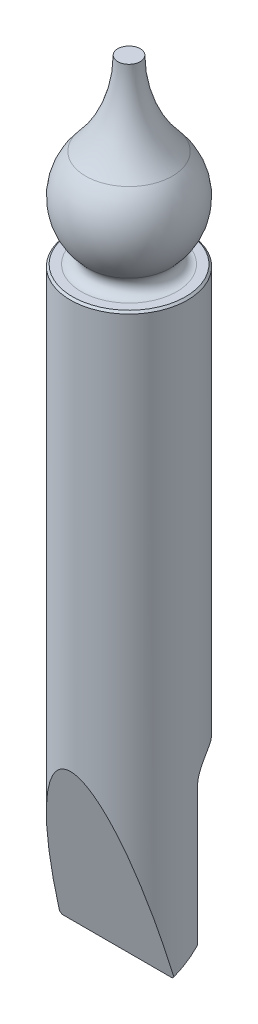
ISO-10303-21;
HEADER;
FILE_DESCRIPTION(('STEP AP214'),'2;1');
FILE_NAME('part.step','',(''),(''),'','','');
FILE_SCHEMA(('AUTOMOTIVE_DESIGN { 1 0 10303 214 1 1 1 1 }'));
ENDSEC;
DATA;
#1=APPLICATION_CONTEXT('core data for automotive mechanical design processes');
#2=APPLICATION_PROTOCOL_DEFINITION('international standard','automotive_design',2000,#1);
#3=PRODUCT_CONTEXT('',#1,'mechanical');
#4=PRODUCT('Part','Part','',(#3));
#5=PRODUCT_RELATED_PRODUCT_CATEGORY('part','',(#4));
#6=PRODUCT_DEFINITION_FORMATION('','',#4);
#7=PRODUCT_DEFINITION_CONTEXT('part definition',#1,'design');
#8=PRODUCT_DEFINITION('design','',#6,#7);
#9=PRODUCT_DEFINITION_SHAPE('','',#8);
#10=(LENGTH_UNIT() NAMED_UNIT(*) SI_UNIT(.MILLI.,.METRE.));
#11=(NAMED_UNIT(*) PLANE_ANGLE_UNIT() SI_UNIT($,.RADIAN.));
#12=(NAMED_UNIT(*) SI_UNIT($,.STERADIAN.) SOLID_ANGLE_UNIT());
#13=UNCERTAINTY_MEASURE_WITH_UNIT(LENGTH_MEASURE(1.E-05),#10,'distance_accuracy_value','');
#14=(GEOMETRIC_REPRESENTATION_CONTEXT(3) GLOBAL_UNCERTAINTY_ASSIGNED_CONTEXT((#13)) GLOBAL_UNIT_ASSIGNED_CONTEXT((#10,
#11,#12)) REPRESENTATION_CONTEXT('',''));
#15=CARTESIAN_POINT('',(0.,0.,0.));
#16=DIRECTION('',(0.,0.,1.));
#17=DIRECTION('',(1.,0.,0.));
#18=AXIS2_PLACEMENT_3D('',#15,#16,#17);
#19=CARTESIAN_POINT('',(-0.575,39.2822667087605,0.));
#20=DIRECTION('',(0.,-1.,0.));
#21=DIRECTION('',(0.,0.,-1.));
#22=AXIS2_PLACEMENT_3D('',#19,#20,#21);
#23=PLANE('',#22);
#24=CARTESIAN_POINT('',(0.,39.2822667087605,0.));
#25=DIRECTION('',(0.,-1.,0.));
#26=DIRECTION('',(0.,0.,-1.));
#27=AXIS2_PLACEMENT_3D('',#24,#25,#26);
#28=CIRCLE('',#27,0.575);
#29=CARTESIAN_POINT('',(0.,39.2822667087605,-0.575));
#30=VERTEX_POINT('',#29);
#31=EDGE_CURVE('E148',#30,#30,#28,.T.);
#32=ORIENTED_EDGE('',*,*,#31,.F.);
#33=EDGE_LOOP('',(#32));
#34=FACE_BOUND('',#33,.T.);
#35=ADVANCED_FACE('F35',(#34),#23,.F.);
#36=CARTESIAN_POINT('',(0.,39.2822667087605,0.));
#37=DIRECTION('',(0.,-1.,0.));
#38=DIRECTION('',(0.,0.,-1.));
#39=AXIS2_PLACEMENT_3D('',#36,#37,#38);
#40=TOROIDAL_SURFACE('',#39,6.925,6.35);
#41=CARTESIAN_POINT('',(0.,35.0157005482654,0.));
#42=DIRECTION('',(0.,-1.,0.));
#43=DIRECTION('',(0.,0.,-1.));
#44=AXIS2_PLACEMENT_3D('',#41,#42,#43);
#45=CIRCLE('',#44,2.22192513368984);
#46=CARTESIAN_POINT('',(-2.22192513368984,35.0157005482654,0.));
#47=VERTEX_POINT('',#46);
#48=EDGE_CURVE('E158',#47,#47,#45,.T.);
#49=ORIENTED_EDGE('',*,*,#48,.F.);
#50=EDGE_LOOP('',(#49));
#51=FACE_BOUND('',#50,.T.);
#52=ORIENTED_EDGE('',*,*,#31,.T.);
#53=EDGE_LOOP('',(#52));
#54=FACE_BOUND('',#53,.T.);
#55=ADVANCED_FACE('F442',(#51,#54),#40,.F.);
#56=CARTESIAN_POINT('',(0.,33.,0.));
#57=DIRECTION('',(0.,-1.,0.));
#58=DIRECTION('',(-1.,0.,0.));
#59=AXIS2_PLACEMENT_3D('',#56,#57,#58);
#60=SPHERICAL_SURFACE('',#59,3.);
#61=CARTESIAN_POINT('',(0.,30.8571428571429,0.));
#62=DIRECTION('',(0.,-1.,0.));
#63=DIRECTION('',(0.,0.,-1.));
#64=AXIS2_PLACEMENT_3D('',#61,#62,#63);
#65=CIRCLE('',#64,2.09956263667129);
#66=CARTESIAN_POINT('',(-2.0995626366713,30.8571428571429,0.));
#67=VERTEX_POINT('',#66);
#68=EDGE_CURVE('E140',#67,#67,#65,.T.);
#69=CARTESIAN_POINT('',(-2.0995626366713,30.8571428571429,0.));
#70=CARTESIAN_POINT('',(-2.1337681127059,30.8906559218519,0.));
#71=CARTESIAN_POINT('',(-2.16716980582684,30.9249892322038,0.));
#72=CARTESIAN_POINT('',(-2.23229208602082,30.9952148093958,0.));
#73=CARTESIAN_POINT('',(-2.26401267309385,31.0311070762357,0.));
#74=CARTESIAN_POINT('',(-2.32569920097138,31.1043690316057,0.));
#75=CARTESIAN_POINT('',(-2.35566514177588,31.1417387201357,0.));
#76=CARTESIAN_POINT('',(-2.41377389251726,31.2178696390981,0.));
#77=CARTESIAN_POINT('',(-2.44191670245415,31.2566308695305,0.));
#78=CARTESIAN_POINT('',(-2.49631461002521,31.3354560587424,0.));
#79=CARTESIAN_POINT('',(-2.52256970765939,31.3755200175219,0.));
#80=CARTESIAN_POINT('',(-2.57313201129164,31.4568587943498,0.));
#81=CARTESIAN_POINT('',(-2.5974392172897,31.4981336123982,0.));
#82=CARTESIAN_POINT('',(-2.64405000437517,31.581799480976,0.));
#83=CARTESIAN_POINT('',(-2.66635358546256,31.6241905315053,0.));
#84=CARTESIAN_POINT('',(-2.70890598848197,31.7099916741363,0.));
#85=CARTESIAN_POINT('',(-2.72915481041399,31.753401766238,0.));
#86=CARTESIAN_POINT('',(-2.76755127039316,31.8411414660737,0.));
#87=CARTESIAN_POINT('',(-2.78569890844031,31.8854710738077,0.));
#88=CARTESIAN_POINT('',(-2.81985139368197,31.9749481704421,0.));
#89=CARTESIAN_POINT('',(-2.83585624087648,32.0200956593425,0.));
#90=CARTESIAN_POINT('',(-2.86568645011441,32.1111050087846,0.));
#91=CARTESIAN_POINT('',(-2.87951181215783,32.1569668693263,0.));
#92=CARTESIAN_POINT('',(-2.90495135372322,32.2492998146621,0.));
#93=CARTESIAN_POINT('',(-2.9165655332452,32.2957708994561,0.));
#94=CARTESIAN_POINT('',(-2.93755608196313,32.3892157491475,0.));
#95=CARTESIAN_POINT('',(-2.94693245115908,32.4361895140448,0.));
#96=CARTESIAN_POINT('',(-2.96342588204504,32.5305320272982,0.));
#97=CARTESIAN_POINT('',(-2.97054294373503,32.5779007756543,0.));
#98=CARTESIAN_POINT('',(-2.98250144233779,32.6729246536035,0.));
#99=CARTESIAN_POINT('',(-2.98734287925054,32.7205797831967,0.));
#100=CARTESIAN_POINT('',(-2.99473902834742,32.8160671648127,0.));
#101=CARTESIAN_POINT('',(-2.99729374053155,32.8638994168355,0.));
#102=CARTESIAN_POINT('',(-3.00011058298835,32.9596313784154,0.));
#103=CARTESIAN_POINT('',(-3.00037271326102,33.0075310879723,0.));
#104=CARTESIAN_POINT('',(-2.99860379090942,33.1032881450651,0.));
#105=CARTESIAN_POINT('',(-2.99657273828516,33.1511454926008,0.));
#106=CARTESIAN_POINT('',(-2.99022210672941,33.2467081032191,0.));
#107=CARTESIAN_POINT('',(-2.98590252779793,33.2944133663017,0.));
#108=CARTESIAN_POINT('',(-2.97498474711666,33.3895624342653,0.));
#109=CARTESIAN_POINT('',(-2.96838654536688,33.4370062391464,0.));
#110=CARTESIAN_POINT('',(-2.95292664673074,33.5315236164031,0.));
#111=CARTESIAN_POINT('',(-2.94406494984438,33.5785971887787,0.));
#112=CARTESIAN_POINT('',(-2.92409837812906,33.6722661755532,0.));
#113=CARTESIAN_POINT('',(-2.91299350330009,33.7188615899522,0.));
#114=CARTESIAN_POINT('',(-2.88856603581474,33.8114674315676,0.));
#115=CARTESIAN_POINT('',(-2.87524344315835,33.8574778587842,0.));
#116=CARTESIAN_POINT('',(-2.84641108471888,33.9488082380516,0.));
#117=CARTESIAN_POINT('',(-2.83090131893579,33.9941281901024,0.));
#118=CARTESIAN_POINT('',(-2.79773017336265,34.0839737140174,0.));
#119=CARTESIAN_POINT('',(-2.7800687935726,34.1284992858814,0.));
#120=CARTESIAN_POINT('',(-2.74263491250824,34.2166539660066,0.));
#121=CARTESIAN_POINT('',(-2.72286241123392,34.2602830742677,0.));
#122=CARTESIAN_POINT('',(-2.68125161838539,34.3465447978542,0.));
#123=CARTESIAN_POINT('',(-2.65941332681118,34.3891774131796,0.));
#124=CARTESIAN_POINT('',(-2.61372102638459,34.4733484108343,0.));
#125=CARTESIAN_POINT('',(-2.58986701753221,34.5148867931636,0.));
#126=CARTESIAN_POINT('',(-2.54019795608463,34.5967740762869,0.));
#127=CARTESIAN_POINT('',(-2.51438290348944,34.6371229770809,0.));
#128=CARTESIAN_POINT('',(-2.46085100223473,34.7165388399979,0.));
#129=CARTESIAN_POINT('',(-2.43313415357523,34.7556058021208,0.));
#130=CARTESIAN_POINT('',(-2.37586197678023,34.8323680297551,0.));
#131=CARTESIAN_POINT('',(-2.34630664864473,34.8700632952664,0.));
#132=CARTESIAN_POINT('',(-2.28542613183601,34.9439964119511,0.));
#133=CARTESIAN_POINT('',(-2.25410094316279,34.9802342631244,0.));
#134=CARTESIAN_POINT('',(-2.22192513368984,35.0157005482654,0.));
#135=B_SPLINE_CURVE_WITH_KNOTS('',3,(#69,#70,#71,#72,#73,#74,#75,#76,#77,#78,#79,#80,#81,#82,
#83,#84,#85,#86,#87,#88,#89,#90,#91,#92,#93,#94,#95,#96,#97,#98,#99,#100,#101,#102,#103,#104,
#105,#106,#107,#108,#109,#110,#111,#112,#113,#114,#115,#116,#117,#118,#119,#120,#121,#122,#123,
#124,#125,#126,#127,#128,#129,#130,#131,#132,#133,#134),.UNSPECIFIED.,.F.,.F.,(4,2,2,2,2,2,2,2,
2,2,2,2,2,2,2,2,2,2,2,2,2,2,2,2,2,2,2,2,2,2,2,2,4),(0.,0.143646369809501,0.287292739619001,
0.430939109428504,0.574585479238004,0.718231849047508,0.86187821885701,1.00552458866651,
1.14917095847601,1.29281732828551,1.43646369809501,1.58011006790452,1.72375643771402,
1.86740280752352,2.01104917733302,2.15469554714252,2.29834191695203,2.44198828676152,
2.58563465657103,2.72928102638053,2.87292739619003,3.01657376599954,3.16022013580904,
3.30386650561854,3.44751287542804,3.59115924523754,3.73480561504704,3.87845198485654,
4.02209835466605,4.16574472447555,4.30939109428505,4.45303746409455,4.59668383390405),.UNSPECIFIED.);
#136=EDGE_CURVE('BSEAM446',#67,#47,#135,.T.);
#137=ORIENTED_EDGE('',*,*,#68,.F.);
#138=ORIENTED_EDGE('',*,*,#48,.T.);
#139=ORIENTED_EDGE('',*,*,#136,.T.);
#140=ORIENTED_EDGE('',*,*,#136,.F.);
#141=EDGE_LOOP('',(#137,#139,#138,#140));
#142=FACE_BOUND('',#141,.T.);
#143=ADVANCED_FACE('F446',(#142),#60,.T.);
#144=CARTESIAN_POINT('',(0.,30.5,0.));
#145=DIRECTION('',(0.,-1.,0.));
#146=DIRECTION('',(0.,0.,-1.));
#147=AXIS2_PLACEMENT_3D('',#144,#145,#146);
#148=TOROIDAL_SURFACE('',#147,2.44948974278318,0.500000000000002);
#149=CARTESIAN_POINT('',(0.,30.,0.));
#150=DIRECTION('',(0.,-1.,0.));
#151=DIRECTION('',(0.,0.,-1.));
#152=AXIS2_PLACEMENT_3D('',#149,#150,#151);
#153=CIRCLE('',#152,2.44948974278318);
#154=CARTESIAN_POINT('',(0.,30.,-2.44948974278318));
#155=VERTEX_POINT('',#154);
#156=EDGE_CURVE('E136',#155,#155,#153,.T.);
#157=ORIENTED_EDGE('',*,*,#156,.F.);
#158=EDGE_LOOP('',(#157));
#159=FACE_BOUND('',#158,.T.);
#160=ORIENTED_EDGE('',*,*,#68,.T.);
#161=EDGE_LOOP('',(#160));
#162=FACE_BOUND('',#161,.T.);
#163=ADVANCED_FACE('F449',(#159,#162),#148,.F.);
#164=CARTESIAN_POINT('',(-3.,30.,0.));
#165=DIRECTION('',(0.,-1.,0.));
#166=DIRECTION('',(0.,0.,-1.));
#167=AXIS2_PLACEMENT_3D('',#164,#165,#166);
#168=PLANE('',#167);
#169=CARTESIAN_POINT('',(0.,30.,0.));
#170=DIRECTION('',(0.,-1.,0.));
#171=DIRECTION('',(0.,0.,-1.));
#172=AXIS2_PLACEMENT_3D('',#169,#170,#171);
#173=CIRCLE('',#172,2.89999999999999);
#174=CARTESIAN_POINT('',(0.,30.,-2.89999999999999));
#175=VERTEX_POINT('',#174);
#176=EDGE_CURVE('E12',#175,#175,#173,.F.);
#177=ORIENTED_EDGE('',*,*,#176,.T.);
#178=EDGE_LOOP('',(#177));
#179=FACE_BOUND('',#178,.T.);
#180=ORIENTED_EDGE('',*,*,#156,.T.);
#181=EDGE_LOOP('',(#180));
#182=FACE_BOUND('',#181,.T.);
#183=ADVANCED_FACE('F202',(#179,#182),#168,.F.);
#184=CARTESIAN_POINT('',(0.,0.,0.));
#185=DIRECTION('',(0.,-1.,0.));
#186=DIRECTION('',(0.,0.,-1.));
#187=AXIS2_PLACEMENT_3D('',#184,#185,#186);
#188=CYLINDRICAL_SURFACE('',#187,3.);
#189=CARTESIAN_POINT('',(0.,29.9,0.));
#190=DIRECTION('',(0.,-1.,0.));
#191=DIRECTION('',(0.,0.,-1.));
#192=AXIS2_PLACEMENT_3D('',#189,#190,#191);
#193=CIRCLE('',#192,3.);
#194=CARTESIAN_POINT('',(0.,29.9,-3.));
#195=VERTEX_POINT('',#194);
#196=EDGE_CURVE('E150',#195,#195,#193,.T.);
#197=ORIENTED_EDGE('',*,*,#196,.T.);
#198=EDGE_LOOP('',(#197));
#199=FACE_BOUND('',#198,.T.);
#200=DIRECTION('',(0.,-1.,0.));
#201=VECTOR('',#200,1.);
#202=CARTESIAN_POINT('',(-2.9449100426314,0.,-0.572280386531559));
#203=LINE('',#202,#201);
#204=CARTESIAN_POINT('',(-2.9449100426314,8.,-0.572280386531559));
#205=VERTEX_POINT('',#204);
#206=CARTESIAN_POINT('',(-2.94495254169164,0.935010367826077,-0.572286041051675));
#207=VERTEX_POINT('',#206);
#208=EDGE_CURVE('E128',#205,#207,#203,.T.);
#209=ORIENTED_EDGE('',*,*,#208,.T.);
#210=CARTESIAN_POINT('',(-2.90538851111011,0.0386896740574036,0.747474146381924));
#211=CARTESIAN_POINT('',(-3.0298907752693,0.365899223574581,0.265682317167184));
#212=CARTESIAN_POINT('',(-3.03145923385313,0.714185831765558,-0.247143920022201));
#213=CARTESIAN_POINT('',(-2.90990635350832,1.04190647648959,-0.729688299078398));
#214=B_SPLINE_CURVE_WITH_KNOTS('',3,(#210,#211,#212,#213),.UNSPECIFIED.,.F.,.F.,(4,4),
(4.46669509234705,4.96419976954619),.UNSPECIFIED.);
#215=CARTESIAN_POINT('',(-2.93278718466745,0.117462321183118,0.631473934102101));
#216=VERTEX_POINT('',#215);
#217=EDGE_CURVE('E109',#207,#216,#214,.F.);
#218=ORIENTED_EDGE('',*,*,#217,.T.);
#219=CARTESIAN_POINT('',(0.,-2.23923048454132,0.));
#220=DIRECTION('',(0.,0.258819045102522,-0.965925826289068));
#221=DIRECTION('',(0.,-0.965925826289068,-0.258819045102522));
#222=AXIS2_PLACEMENT_3D('',#219,#220,#221);
#223=ELLIPSE('',#222,11.5911099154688,3.);
#224=CARTESIAN_POINT('',(2.93278718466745,0.117462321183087,0.631473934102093));
#225=VERTEX_POINT('',#224);
#226=EDGE_CURVE('E125',#216,#225,#223,.T.);
#227=ORIENTED_EDGE('',*,*,#226,.T.);
#228=CARTESIAN_POINT('',(2.90990635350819,1.04190647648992,-0.729688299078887));
#229=CARTESIAN_POINT('',(3.03145923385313,0.714185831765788,-0.24714392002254));
#230=CARTESIAN_POINT('',(3.02989077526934,0.365899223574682,0.265682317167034));
#231=CARTESIAN_POINT('',(2.9053885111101,0.0386896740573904,0.747474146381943));
#232=B_SPLINE_CURVE_WITH_KNOTS('',3,(#228,#229,#230,#231),.UNSPECIFIED.,.F.,.F.,(4,4),
(1.31898553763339,1.8164902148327),.UNSPECIFIED.);
#233=CARTESIAN_POINT('',(2.9449100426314,0.935010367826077,-0.572280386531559));
#234=VERTEX_POINT('',#233);
#235=EDGE_CURVE('E130',#225,#234,#232,.F.);
#236=ORIENTED_EDGE('',*,*,#235,.T.);
#237=DIRECTION('',(0.,-1.,0.));
#238=VECTOR('',#237,1.);
#239=CARTESIAN_POINT('',(2.9449100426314,0.,-0.572280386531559));
#240=LINE('',#239,#238);
#241=CARTESIAN_POINT('',(2.9449100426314,8.,-0.572280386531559));
#242=VERTEX_POINT('',#241);
#243=EDGE_CURVE('E166',#234,#242,#240,.F.);
#244=ORIENTED_EDGE('',*,*,#243,.T.);
#245=CARTESIAN_POINT('',(2.41702691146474,9.15253919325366,-1.77707087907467));
#246=CARTESIAN_POINT('',(2.8330422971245,9.19197157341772,-1.23380111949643));
#247=CARTESIAN_POINT('',(2.95387614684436,8.6679028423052,-0.546867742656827));
#248=CARTESIAN_POINT('',(2.9449100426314,8.,-0.57228038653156));
#249=B_SPLINE_CURVE_WITH_KNOTS('',3,(#245,#246,#247,#248),.UNSPECIFIED.,.F.,.F.,(4,4),(0.,
0.00190616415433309),.UNSPECIFIED.);
#250=CARTESIAN_POINT('',(2.41702691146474,9.15253919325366,-1.77707087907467));
#251=VERTEX_POINT('',#250);
#252=EDGE_CURVE('E169',#242,#251,#249,.F.);
#253=ORIENTED_EDGE('',*,*,#252,.T.);
#254=CARTESIAN_POINT('',(0.,9.15253919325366,0.));
#255=DIRECTION('',(0.,1.,0.));
#256=DIRECTION('',(0.,0.,1.));
#257=AXIS2_PLACEMENT_3D('',#254,#255,#256);
#258=CIRCLE('',#257,3.);
#259=CARTESIAN_POINT('',(-2.41702691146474,9.15253919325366,-1.77707087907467));
#260=VERTEX_POINT('',#259);
#261=EDGE_CURVE('E173',#251,#260,#258,.T.);
#262=ORIENTED_EDGE('',*,*,#261,.T.);
#263=CARTESIAN_POINT('',(-2.9449100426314,8.,-0.572280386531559));
#264=CARTESIAN_POINT('',(-2.95358423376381,8.67201574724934,-0.548573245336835));
#265=CARTESIAN_POINT('',(-2.83230342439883,9.19113963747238,-1.23508206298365));
#266=CARTESIAN_POINT('',(-2.41702691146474,9.15253919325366,-1.77707087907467));
#267=B_SPLINE_CURVE_WITH_KNOTS('',3,(#263,#264,#265,#266),.UNSPECIFIED.,.F.,.F.,(4,4),(0.,
0.00190531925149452),.UNSPECIFIED.);
#268=EDGE_CURVE('E182',#260,#205,#267,.F.);
#269=ORIENTED_EDGE('',*,*,#268,.T.);
#270=EDGE_LOOP('',(#209,#218,#227,#236,#244,#253,#262,#269));
#271=FACE_BOUND('',#270,.T.);
#272=ADVANCED_FACE('F124',(#199,#271),#188,.T.);
#273=CARTESIAN_POINT('',(-5.,0.913655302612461,-0.7));
#274=DIRECTION('',(0.,0.,1.));
#275=DIRECTION('',(1.,0.,0.));
#276=AXIS2_PLACEMENT_3D('',#273,#274,#275);
#277=PLANE('',#276);
#278=DIRECTION('',(1.,0.,0.));
#279=VECTOR('',#278,1.);
#280=CARTESIAN_POINT('',(-5.,0.913655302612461,-0.7));
#281=LINE('',#280,#279);
#282=CARTESIAN_POINT('',(-2.82410340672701,0.908048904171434,-0.698099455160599));
#283=VERTEX_POINT('',#282);
#284=CARTESIAN_POINT('',(2.82411201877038,0.908035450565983,-0.698094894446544));
#285=VERTEX_POINT('',#284);
#286=EDGE_CURVE('E137',#283,#285,#281,.T.);
#287=ORIENTED_EDGE('',*,*,#286,.F.);
#288=DIRECTION('',(0.,1.,0.));
#289=VECTOR('',#288,1.);
#290=CARTESIAN_POINT('',(-2.81719042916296,0.913655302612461,-0.7));
#291=LINE('',#290,#289);
#292=CARTESIAN_POINT('',(-2.81719042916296,8.,-0.700000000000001));
#293=VERTEX_POINT('',#292);
#294=EDGE_CURVE('E317',#283,#293,#291,.T.);
#295=ORIENTED_EDGE('',*,*,#294,.T.);
#296=DIRECTION('',(1.,0.,0.));
#297=VECTOR('',#296,1.);
#298=CARTESIAN_POINT('',(-5.,8.,-0.700000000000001));
#299=LINE('',#298,#297);
#300=CARTESIAN_POINT('',(2.81719042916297,8.,-0.700000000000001));
#301=VERTEX_POINT('',#300);
#302=EDGE_CURVE('E143',#293,#301,#299,.T.);
#303=ORIENTED_EDGE('',*,*,#302,.T.);
#304=DIRECTION('',(0.,-1.,0.));
#305=VECTOR('',#304,1.);
#306=CARTESIAN_POINT('',(2.81719042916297,0.913655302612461,-0.7));
#307=LINE('',#306,#305);
#308=EDGE_CURVE('E241',#301,#285,#307,.T.);
#309=ORIENTED_EDGE('',*,*,#308,.T.);
#310=EDGE_LOOP('',(#287,#295,#303,#309));
#311=FACE_BOUND('',#310,.T.);
#312=ADVANCED_FACE('F201',(#311),#277,.F.);
#313=CARTESIAN_POINT('',(-5.,8.,-1.7));
#314=DIRECTION('',(1.,0.,0.));
#315=DIRECTION('',(0.,0.,-1.));
#316=AXIS2_PLACEMENT_3D('',#313,#314,#315);
#317=CYLINDRICAL_SURFACE('',#316,1.);
#318=ORIENTED_EDGE('',*,*,#302,.F.);
#319=CARTESIAN_POINT('',(-2.31220138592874,9.,-1.7));
#320=CARTESIAN_POINT('',(-2.70946751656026,9.03349165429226,-1.25013853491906));
#321=CARTESIAN_POINT('',(-2.82548842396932,8.58307409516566,-0.680322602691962));
#322=CARTESIAN_POINT('',(-2.81719042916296,8.,-0.700000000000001));
#323=B_SPLINE_CURVE_WITH_KNOTS('',3,(#319,#320,#321,#322),.UNSPECIFIED.,.F.,.F.,(4,4),(0.,
0.00190531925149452),.UNSPECIFIED.);
#324=CARTESIAN_POINT('',(-2.31220138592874,9.,-1.7));
#325=VERTEX_POINT('',#324);
#326=EDGE_CURVE('E58',#293,#325,#323,.F.);
#327=ORIENTED_EDGE('',*,*,#326,.T.);
#328=DIRECTION('',(1.,0.,0.));
#329=VECTOR('',#328,1.);
#330=CARTESIAN_POINT('',(-5.,9.,-1.7));
#331=LINE('',#330,#329);
#332=CARTESIAN_POINT('',(2.31220138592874,9.,-1.7));
#333=VERTEX_POINT('',#332);
#334=EDGE_CURVE('E609',#325,#333,#331,.T.);
#335=ORIENTED_EDGE('',*,*,#334,.T.);
#336=CARTESIAN_POINT('',(2.81719042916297,8.,-0.700000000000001));
#337=CARTESIAN_POINT('',(2.82576767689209,8.5795055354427,-0.678907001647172));
#338=CARTESIAN_POINT('',(2.71017434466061,9.03421348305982,-1.24907532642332));
#339=CARTESIAN_POINT('',(2.31220138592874,9.,-1.7));
#340=B_SPLINE_CURVE_WITH_KNOTS('',3,(#336,#337,#338,#339),.UNSPECIFIED.,.F.,.F.,(4,4),(0.,
0.00190616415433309),.UNSPECIFIED.);
#341=EDGE_CURVE('E307',#333,#301,#340,.F.);
#342=ORIENTED_EDGE('',*,*,#341,.T.);
#343=EDGE_LOOP('',(#318,#327,#335,#342));
#344=FACE_BOUND('',#343,.T.);
#345=ADVANCED_FACE('F519',(#344),#317,.F.);
#346=CARTESIAN_POINT('',(-5.,9.,-1.7));
#347=DIRECTION('',(0.,1.,0.));
#348=DIRECTION('',(0.,0.,1.));
#349=AXIS2_PLACEMENT_3D('',#346,#347,#348);
#350=PLANE('',#349);
#351=ORIENTED_EDGE('',*,*,#334,.F.);
#352=CARTESIAN_POINT('',(0.,9.,0.));
#353=DIRECTION('',(0.,1.,0.));
#354=DIRECTION('',(0.,0.,1.));
#355=AXIS2_PLACEMENT_3D('',#352,#353,#354);
#356=CIRCLE('',#355,2.86989115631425);
#357=EDGE_CURVE('E45',#325,#333,#356,.F.);
#358=ORIENTED_EDGE('',*,*,#357,.T.);
#359=EDGE_LOOP('',(#351,#358));
#360=FACE_BOUND('',#359,.T.);
#361=ADVANCED_FACE('F512',(#360),#350,.F.);
#362=CARTESIAN_POINT('',(-5.,0.,0.599999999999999));
#363=DIRECTION('',(0.,0.818149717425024,0.575005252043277));
#364=DIRECTION('',(0.,-0.575005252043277,0.818149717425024));
#365=AXIS2_PLACEMENT_3D('',#362,#363,#364);
#366=PLANE('',#365);
#367=DIRECTION('',(1.,0.,0.));
#368=VECTOR('',#367,1.);
#369=CARTESIAN_POINT('',(-5.,0.,0.599999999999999));
#370=LINE('',#369,#368);
#371=CARTESIAN_POINT('',(-2.82324746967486,0.,0.599999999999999));
#372=VERTEX_POINT('',#371);
#373=CARTESIAN_POINT('',(2.82324485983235,0.,0.599999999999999));
#374=VERTEX_POINT('',#373);
#375=EDGE_CURVE('E233',#372,#374,#370,.T.);
#376=ORIENTED_EDGE('',*,*,#375,.F.);
#377=CARTESIAN_POINT('',(-2.81194308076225,0.958469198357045,-0.76376372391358));
#378=CARTESIAN_POINT('',(-2.929403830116,0.630748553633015,-0.297464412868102));
#379=CARTESIAN_POINT('',(-2.92788817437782,0.282461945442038,0.198097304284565));
#380=CARTESIAN_POINT('',(-2.80757733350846,-0.0447476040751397,0.663669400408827));
#381=B_SPLINE_CURVE_WITH_KNOTS('',3,(#377,#378,#379,#380),.UNSPECIFIED.,.F.,.F.,(4,4),
(4.46669509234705,4.96419976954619),.UNSPECIFIED.);
#382=EDGE_CURVE('E111',#372,#283,#381,.F.);
#383=ORIENTED_EDGE('',*,*,#382,.T.);
#384=ORIENTED_EDGE('',*,*,#286,.T.);
#385=CARTESIAN_POINT('',(2.80757733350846,-0.0447476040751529,0.663669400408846));
#386=CARTESIAN_POINT('',(2.92788817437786,0.282461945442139,0.198097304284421));
#387=CARTESIAN_POINT('',(2.929403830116,0.630748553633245,-0.297464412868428));
#388=CARTESIAN_POINT('',(2.81194308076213,0.958469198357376,-0.763763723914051));
#389=B_SPLINE_CURVE_WITH_KNOTS('',3,(#385,#386,#387,#388),.UNSPECIFIED.,.F.,.F.,(4,4),
(1.31898553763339,1.8164902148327),.UNSPECIFIED.);
#390=EDGE_CURVE('E118',#285,#374,#389,.F.);
#391=ORIENTED_EDGE('',*,*,#390,.T.);
#392=EDGE_LOOP('',(#376,#383,#384,#391));
#393=FACE_BOUND('',#392,.T.);
#394=ADVANCED_FACE('F203',(#393),#366,.F.);
#395=CARTESIAN_POINT('',(-5.,0.,0.599999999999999));
#396=DIRECTION('',(0.,0.258819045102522,-0.965925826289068));
#397=DIRECTION('',(0.,0.965925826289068,0.258819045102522));
#398=AXIS2_PLACEMENT_3D('',#395,#396,#397);
#399=PLANE('',#398);
#400=ORIENTED_EDGE('',*,*,#226,.F.);
#401=CARTESIAN_POINT('',(-2.82324719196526,-8.30603192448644E-07,0.6000011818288));
#402=CARTESIAN_POINT('',(-2.82781514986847,0.00488963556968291,0.601386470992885));
#403=CARTESIAN_POINT('',(-2.83238411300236,0.00978168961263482,0.602762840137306));
#404=CARTESIAN_POINT('',(-2.84152168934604,0.0195665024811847,0.605497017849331));
#405=CARTESIAN_POINT('',(-2.84609030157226,0.0244592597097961,0.60685483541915));
#406=CARTESIAN_POINT('',(-2.85522711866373,0.0342454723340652,0.609551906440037));
#407=CARTESIAN_POINT('',(-2.85979532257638,0.0391389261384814,0.610891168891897));
#408=CARTESIAN_POINT('',(-2.86893126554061,0.0489265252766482,0.613551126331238));
#409=CARTESIAN_POINT('',(-2.87349900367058,0.0538206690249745,0.614871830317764));
#410=CARTESIAN_POINT('',(-2.88263395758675,0.06360964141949,0.617494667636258));
#411=CARTESIAN_POINT('',(-2.88720117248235,0.0685044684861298,0.618796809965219));
#412=CARTESIAN_POINT('',(-2.89633502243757,0.0782948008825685,0.62138252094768));
#413=CARTESIAN_POINT('',(-2.90090165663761,0.0831903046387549,0.62266609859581));
#414=CARTESIAN_POINT('',(-2.91003428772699,0.092981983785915,0.625214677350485));
#415=CARTESIAN_POINT('',(-2.91460028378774,0.0978781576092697,0.626479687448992));
#416=CARTESIAN_POINT('',(-2.92373158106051,0.107671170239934,0.628991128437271));
#417=CARTESIAN_POINT('',(-2.92829688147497,0.11256800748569,0.630237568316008));
#418=CARTESIAN_POINT('',(-2.93286294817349,0.117466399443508,0.63147502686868));
#419=B_SPLINE_CURVE_WITH_KNOTS('',3,(#401,#402,#403,#404,#405,#406,#407,#408,#409,#410,#411,
#412,#413,#414,#415,#416,#417,#418),.UNSPECIFIED.,.F.,.F.,(4,2,2,2,2,2,2,2,4),(0.,
0.0205016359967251,0.0409929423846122,0.0614739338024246,0.0819446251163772,0.102405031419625,
0.12285516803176,0.143295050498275,0.163724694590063),.UNSPECIFIED.);
#420=EDGE_CURVE('E104',#216,#372,#419,.F.);
#421=ORIENTED_EDGE('',*,*,#420,.T.);
#422=ORIENTED_EDGE('',*,*,#375,.T.);
#423=CARTESIAN_POINT('',(2.93286294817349,0.117466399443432,0.631475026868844));
#424=CARTESIAN_POINT('',(2.92829688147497,0.112568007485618,0.630237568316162));
#425=CARTESIAN_POINT('',(2.92373158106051,0.107671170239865,0.628991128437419));
#426=CARTESIAN_POINT('',(2.91460028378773,0.0978781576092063,0.626479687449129));
#427=CARTESIAN_POINT('',(2.91003428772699,0.0929819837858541,0.625214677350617));
#428=CARTESIAN_POINT('',(2.90090165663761,0.0831903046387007,0.622666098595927));
#429=CARTESIAN_POINT('',(2.89633502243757,0.0782948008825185,0.621382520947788));
#430=CARTESIAN_POINT('',(2.88720117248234,0.0685044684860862,0.618796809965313));
#431=CARTESIAN_POINT('',(2.88263395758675,0.0636096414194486,0.617494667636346));
#432=CARTESIAN_POINT('',(2.87349900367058,0.0538206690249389,0.61487183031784));
#433=CARTESIAN_POINT('',(2.86893126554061,0.048926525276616,0.613551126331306));
#434=CARTESIAN_POINT('',(2.85979532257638,0.0391389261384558,0.610891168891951));
#435=CARTESIAN_POINT('',(2.85522711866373,0.0342454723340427,0.609551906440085));
#436=CARTESIAN_POINT('',(2.84609030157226,0.0244592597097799,0.606854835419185));
#437=CARTESIAN_POINT('',(2.84152168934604,0.0195665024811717,0.605497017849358));
#438=CARTESIAN_POINT('',(2.83238411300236,0.00978168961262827,0.60276284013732));
#439=CARTESIAN_POINT('',(2.82781514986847,0.00488963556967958,0.601386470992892));
#440=CARTESIAN_POINT('',(2.82324719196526,-8.30603192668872E-07,0.6000011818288));
#441=B_SPLINE_CURVE_WITH_KNOTS('',3,(#423,#424,#425,#426,#427,#428,#429,#430,#431,#432,#433,
#434,#435,#436,#437,#438,#439,#440),.UNSPECIFIED.,.F.,.F.,(4,2,2,2,2,2,2,2,4),(0.,
0.0204296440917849,0.040869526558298,0.0613196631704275,0.0817800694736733,0.102250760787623,
0.122731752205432,0.143223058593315,0.163724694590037),.UNSPECIFIED.);
#442=EDGE_CURVE('E119',#374,#225,#441,.F.);
#443=ORIENTED_EDGE('',*,*,#442,.T.);
#444=EDGE_LOOP('',(#400,#421,#422,#443));
#445=FACE_BOUND('',#444,.T.);
#446=ADVANCED_FACE('F133',(#445),#399,.F.);
#447=CARTESIAN_POINT('',(2.9053885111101,0.0386896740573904,0.747474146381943));
#448=CARTESIAN_POINT('',(3.02989077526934,0.365899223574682,0.265682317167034));
#449=CARTESIAN_POINT('',(3.03145923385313,0.714185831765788,-0.24714392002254));
#450=CARTESIAN_POINT('',(2.90990635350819,1.04190647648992,-0.729688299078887));
#451=CARTESIAN_POINT('',(2.80757733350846,-0.0447476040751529,0.663669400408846));
#452=CARTESIAN_POINT('',(2.92788817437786,0.282461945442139,0.198097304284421));
#453=CARTESIAN_POINT('',(2.929403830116,0.630748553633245,-0.297464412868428));
#454=CARTESIAN_POINT('',(2.81194308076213,0.958469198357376,-0.763763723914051));
#455=B_SPLINE_SURFACE_WITH_KNOTS('',1,3,((#447,#448,#449,#450),(#451,#452,#453,#454)),
.UNSPECIFIED.,.F.,.F.,.F.,(2,2),(4,4),(0.,1.),(1.31898553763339,1.8164902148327),.UNSPECIFIED.);
#456=CARTESIAN_POINT('',(2.82884725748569,0.908607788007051,-0.692818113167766));
#457=CARTESIAN_POINT('',(2.83371472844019,0.909712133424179,-0.687916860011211));
#458=CARTESIAN_POINT('',(2.83857299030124,0.910814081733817,-0.683005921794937));
#459=CARTESIAN_POINT('',(2.84828369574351,0.913016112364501,-0.67315203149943));
#460=CARTESIAN_POINT('',(2.85313609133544,0.914116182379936,-0.668209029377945));
#461=CARTESIAN_POINT('',(2.86283490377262,0.91631448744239,-0.658291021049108));
#462=CARTESIAN_POINT('',(2.8676812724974,0.917412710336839,-0.653315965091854));
#463=CARTESIAN_POINT('',(2.87736787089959,0.919607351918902,-0.643333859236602));
#464=CARTESIAN_POINT('',(2.88220805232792,0.920703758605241,-0.638326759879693));
#465=CARTESIAN_POINT('',(2.89188211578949,0.922894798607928,-0.628280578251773));
#466=CARTESIAN_POINT('',(2.89671594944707,0.923989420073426,-0.623241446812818));
#467=CARTESIAN_POINT('',(2.90637715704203,0.926176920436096,-0.613131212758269));
#468=CARTESIAN_POINT('',(2.91120448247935,0.927269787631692,-0.608060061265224));
#469=CARTESIAN_POINT('',(2.92085251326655,0.929453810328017,-0.597885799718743));
#470=CARTESIAN_POINT('',(2.92567316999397,0.930544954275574,-0.592782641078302));
#471=CARTESIAN_POINT('',(2.93530770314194,0.932725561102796,-0.582544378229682));
#472=CARTESIAN_POINT('',(2.94012153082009,0.933815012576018,-0.577409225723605));
#473=CARTESIAN_POINT('',(2.94492577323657,0.934902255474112,-0.572264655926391));
#474=B_SPLINE_CURVE_WITH_KNOTS('',3,(#456,#457,#458,#459,#460,#461,#462,#463,#464,#465,#466,
#467,#468,#469,#470,#471,#472,#473),.UNSPECIFIED.,.F.,.F.,(4,2,2,2,2,2,2,2,4),(0.,
0.0209858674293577,0.0420263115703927,0.0631213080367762,0.0842708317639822,0.105474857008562,
0.126733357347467,0.148046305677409,0.169413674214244),.UNSPECIFIED.);
#475=EDGE_CURVE('E227',#234,#285,#474,.F.);
#476=ORIENTED_EDGE('',*,*,#442,.F.);
#477=ORIENTED_EDGE('',*,*,#390,.F.);
#478=ORIENTED_EDGE('',*,*,#475,.F.);
#479=ORIENTED_EDGE('',*,*,#235,.F.);
#480=EDGE_LOOP('',(#476,#477,#478,#479));
#481=FACE_BOUND('',#480,.T.);
#482=ADVANCED_FACE('F229',(#481),#455,.T.);
#483=CARTESIAN_POINT('',(2.9449100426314,0.,-0.572280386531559));
#484=DIRECTION('',(0.707106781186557,0.,-0.707106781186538));
#485=DIRECTION('',(-0.707106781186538,0.,-0.707106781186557));
#486=AXIS2_PLACEMENT_3D('',#483,#484,#485);
#487=PLANE('',#486);
#488=ORIENTED_EDGE('',*,*,#475,.T.);
#489=ORIENTED_EDGE('',*,*,#308,.F.);
#490=CARTESIAN_POINT('',(2.9449100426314,8.,-0.57228038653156));
#491=CARTESIAN_POINT('',(2.81719042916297,8.,-0.700000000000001));
#492=B_SPLINE_CURVE_WITH_KNOTS('',1,(#490,#491),.UNSPECIFIED.,.F.,.F.,(2,2),(0.,1.),.UNSPECIFIED.);
#493=EDGE_CURVE('E234',#242,#301,#492,.T.);
#494=ORIENTED_EDGE('',*,*,#493,.F.);
#495=ORIENTED_EDGE('',*,*,#243,.F.);
#496=EDGE_LOOP('',(#488,#489,#494,#495));
#497=FACE_BOUND('',#496,.T.);
#498=ADVANCED_FACE('F237',(#497),#487,.T.);
#499=CARTESIAN_POINT('',(2.9449100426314,8.,-0.57228038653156));
#500=CARTESIAN_POINT('',(2.95387614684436,8.6679028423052,-0.546867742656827));
#501=CARTESIAN_POINT('',(2.8330422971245,9.19197157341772,-1.23380111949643));
#502=CARTESIAN_POINT('',(2.41702691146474,9.15253919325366,-1.77707087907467));
#503=CARTESIAN_POINT('',(2.81719042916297,8.,-0.700000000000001));
#504=CARTESIAN_POINT('',(2.82576767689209,8.5795055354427,-0.678907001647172));
#505=CARTESIAN_POINT('',(2.71017434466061,9.03421348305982,-1.24907532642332));
#506=CARTESIAN_POINT('',(2.31220138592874,9.,-1.7));
#507=B_SPLINE_SURFACE_WITH_KNOTS('',1,3,((#499,#500,#501,#502),(#503,#504,#505,#506)),
.UNSPECIFIED.,.F.,.F.,.F.,(2,2),(4,4),(0.,1.),(0.,0.00190616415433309),.UNSPECIFIED.);
#508=CARTESIAN_POINT('',(2.31220138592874,9.,-1.7));
#509=CARTESIAN_POINT('',(2.41702691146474,9.15253919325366,-1.77707087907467));
#510=B_SPLINE_CURVE_WITH_KNOTS('',1,(#508,#509),.UNSPECIFIED.,.F.,.F.,(2,2),(0.,1.),.UNSPECIFIED.);
#511=EDGE_CURVE('E245',#251,#333,#510,.F.);
#512=ORIENTED_EDGE('',*,*,#493,.T.);
#513=ORIENTED_EDGE('',*,*,#341,.F.);
#514=ORIENTED_EDGE('',*,*,#511,.F.);
#515=ORIENTED_EDGE('',*,*,#252,.F.);
#516=EDGE_LOOP('',(#512,#513,#514,#515));
#517=FACE_BOUND('',#516,.T.);
#518=ADVANCED_FACE('F250',(#517),#507,.T.);
#519=CARTESIAN_POINT('',(0.,9.15253919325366,0.));
#520=DIRECTION('',(0.,1.,0.));
#521=DIRECTION('',(0.,0.,1.));
#522=AXIS2_PLACEMENT_3D('',#519,#520,#521);
#523=CONICAL_SURFACE('',#522,3.,0.706206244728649);
#524=ORIENTED_EDGE('',*,*,#511,.T.);
#525=ORIENTED_EDGE('',*,*,#357,.F.);
#526=CARTESIAN_POINT('',(-2.41702691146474,9.15253919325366,-1.77707087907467));
#527=CARTESIAN_POINT('',(-2.31220138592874,9.,-1.7));
#528=B_SPLINE_CURVE_WITH_KNOTS('',1,(#526,#527),.UNSPECIFIED.,.F.,.F.,(2,2),(0.,1.),.UNSPECIFIED.);
#529=EDGE_CURVE('E322',#260,#325,#528,.T.);
#530=ORIENTED_EDGE('',*,*,#529,.F.);
#531=ORIENTED_EDGE('',*,*,#261,.F.);
#532=EDGE_LOOP('',(#524,#525,#530,#531));
#533=FACE_BOUND('',#532,.T.);
#534=ADVANCED_FACE('F272',(#533),#523,.T.);
#535=CARTESIAN_POINT('',(-2.41702691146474,9.15253919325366,-1.77707087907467));
#536=CARTESIAN_POINT('',(-2.83230342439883,9.19113963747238,-1.23508206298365));
#537=CARTESIAN_POINT('',(-2.95358423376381,8.67201574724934,-0.548573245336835));
#538=CARTESIAN_POINT('',(-2.9449100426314,8.,-0.572280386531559));
#539=CARTESIAN_POINT('',(-2.31220138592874,9.,-1.7));
#540=CARTESIAN_POINT('',(-2.70946751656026,9.03349165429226,-1.25013853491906));
#541=CARTESIAN_POINT('',(-2.82548842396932,8.58307409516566,-0.680322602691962));
#542=CARTESIAN_POINT('',(-2.81719042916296,8.,-0.700000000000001));
#543=B_SPLINE_SURFACE_WITH_KNOTS('',1,3,((#535,#536,#537,#538),(#539,#540,#541,#542)),
.UNSPECIFIED.,.F.,.F.,.F.,(2,2),(4,4),(0.,1.),(0.,0.00190531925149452),.UNSPECIFIED.);
#544=CARTESIAN_POINT('',(-2.81719042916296,8.,-0.700000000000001));
#545=CARTESIAN_POINT('',(-2.9449100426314,8.,-0.572280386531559));
#546=B_SPLINE_CURVE_WITH_KNOTS('',1,(#544,#545),.UNSPECIFIED.,.F.,.F.,(2,2),(0.,1.),.UNSPECIFIED.);
#547=EDGE_CURVE('E384',#205,#293,#546,.F.);
#548=ORIENTED_EDGE('',*,*,#529,.T.);
#549=ORIENTED_EDGE('',*,*,#326,.F.);
#550=ORIENTED_EDGE('',*,*,#547,.F.);
#551=ORIENTED_EDGE('',*,*,#268,.F.);
#552=EDGE_LOOP('',(#548,#549,#550,#551));
#553=FACE_BOUND('',#552,.T.);
#554=ADVANCED_FACE('F336',(#553),#543,.T.);
#555=CARTESIAN_POINT('',(-2.9449100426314,0.,-0.572280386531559));
#556=DIRECTION('',(0.707106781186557,0.,0.707106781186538));
#557=DIRECTION('',(0.707106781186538,0.,-0.707106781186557));
#558=AXIS2_PLACEMENT_3D('',#555,#556,#557);
#559=PLANE('',#558);
#560=ORIENTED_EDGE('',*,*,#547,.T.);
#561=ORIENTED_EDGE('',*,*,#294,.F.);
#562=CARTESIAN_POINT('',(-2.94496112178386,0.934912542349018,-0.572229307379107));
#563=CARTESIAN_POINT('',(-2.94015542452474,0.933824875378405,-0.577375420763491));
#564=CARTESIAN_POINT('',(-2.93534013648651,0.932734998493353,-0.582512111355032));
#565=CARTESIAN_POINT('',(-2.9257026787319,0.930553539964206,-0.59275343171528));
#566=CARTESIAN_POINT('',(-2.92088055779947,0.929461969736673,-0.597858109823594));
#567=CARTESIAN_POINT('',(-2.91122959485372,0.927277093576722,-0.608035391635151));
#568=CARTESIAN_POINT('',(-2.90640080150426,0.926183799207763,-0.613108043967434));
#569=CARTESIAN_POINT('',(-2.89673665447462,0.923995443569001,-0.623221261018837));
#570=CARTESIAN_POINT('',(-2.89190134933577,0.92290039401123,-0.628261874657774));
#571=CARTESIAN_POINT('',(-2.88222433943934,0.920708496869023,-0.63831100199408));
#572=CARTESIAN_POINT('',(-2.87738268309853,0.919611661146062,-0.64331956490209));
#573=CARTESIAN_POINT('',(-2.8676931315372,0.917416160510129,-0.653304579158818));
#574=CARTESIAN_POINT('',(-2.86284528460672,0.916317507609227,-0.658281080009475));
#575=CARTESIAN_POINT('',(-2.85314351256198,0.914118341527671,-0.668201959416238));
#576=CARTESIAN_POINT('',(-2.84828963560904,0.913017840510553,-0.673146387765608));
#577=CARTESIAN_POINT('',(-2.83857596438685,0.91081494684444,-0.683003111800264));
#578=CARTESIAN_POINT('',(-2.83371621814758,0.909712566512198,-0.687915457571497));
#579=CARTESIAN_POINT('',(-2.82884725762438,0.908607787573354,-0.692818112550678));
#580=B_SPLINE_CURVE_WITH_KNOTS('',3,(#562,#563,#564,#565,#566,#567,#568,#569,#570,#571,#572,
#573,#574,#575,#576,#577,#578,#579),.UNSPECIFIED.,.F.,.F.,(4,2,2,2,2,2,2,2,4),(0.,
0.0213738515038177,0.0426932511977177,0.0639581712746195,0.0851685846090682,0.106324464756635,
0.127425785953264,0.148472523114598,0.169464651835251),.UNSPECIFIED.);
#581=EDGE_CURVE('E389',#207,#283,#580,.T.);
#582=ORIENTED_EDGE('',*,*,#581,.F.);
#583=ORIENTED_EDGE('',*,*,#208,.F.);
#584=EDGE_LOOP('',(#560,#561,#582,#583));
#585=FACE_BOUND('',#584,.T.);
#586=ADVANCED_FACE('F347',(#585),#559,.F.);
#587=CARTESIAN_POINT('',(-2.90990635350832,1.04190647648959,-0.729688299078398));
#588=CARTESIAN_POINT('',(-3.03145923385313,0.714185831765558,-0.247143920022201));
#589=CARTESIAN_POINT('',(-3.0298907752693,0.365899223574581,0.265682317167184));
#590=CARTESIAN_POINT('',(-2.90538851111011,0.0386896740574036,0.747474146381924));
#591=CARTESIAN_POINT('',(-2.81194308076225,0.958469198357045,-0.76376372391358));
#592=CARTESIAN_POINT('',(-2.929403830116,0.630748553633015,-0.297464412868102));
#593=CARTESIAN_POINT('',(-2.92788817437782,0.282461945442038,0.198097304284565));
#594=CARTESIAN_POINT('',(-2.80757733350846,-0.0447476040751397,0.663669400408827));
#595=B_SPLINE_SURFACE_WITH_KNOTS('',1,3,((#587,#588,#589,#590),(#591,#592,#593,#594)),
.UNSPECIFIED.,.F.,.F.,.F.,(2,2),(4,4),(0.,1.),(4.46669509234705,4.96419976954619),.UNSPECIFIED.);
#596=ORIENTED_EDGE('',*,*,#581,.T.);
#597=ORIENTED_EDGE('',*,*,#382,.F.);
#598=ORIENTED_EDGE('',*,*,#420,.F.);
#599=ORIENTED_EDGE('',*,*,#217,.F.);
#600=EDGE_LOOP('',(#596,#597,#598,#599));
#601=FACE_BOUND('',#600,.T.);
#602=ADVANCED_FACE('F108',(#601),#595,.T.);
#603=CARTESIAN_POINT('',(0.,29.9,0.));
#604=DIRECTION('',(0.,-1.,0.));
#605=DIRECTION('',(0.,0.,-1.));
#606=AXIS2_PLACEMENT_3D('',#603,#604,#605);
#607=CONICAL_SURFACE('',#606,3.,0.78539816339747);
#608=ORIENTED_EDGE('',*,*,#176,.F.);
#609=EDGE_LOOP('',(#608));
#610=FACE_BOUND('',#609,.T.);
#611=ORIENTED_EDGE('',*,*,#196,.F.);
#612=EDGE_LOOP('',(#611));
#613=FACE_BOUND('',#612,.T.);
#614=ADVANCED_FACE('F37',(#610,#613),#607,.T.);
#615=CLOSED_SHELL('',(#35,#55,#143,#163,#183,#272,#312,#345,#361,#394,#446,#482,#498,#518,#534,
#554,#586,#602,#614));
#616=MANIFOLD_SOLID_BREP('B2',#615);
#617=ADVANCED_BREP_SHAPE_REPRESENTATION('',(#18,#616),#14);
#618=SHAPE_DEFINITION_REPRESENTATION(#9,#617);
ENDSEC;
END-ISO-10303-21;
